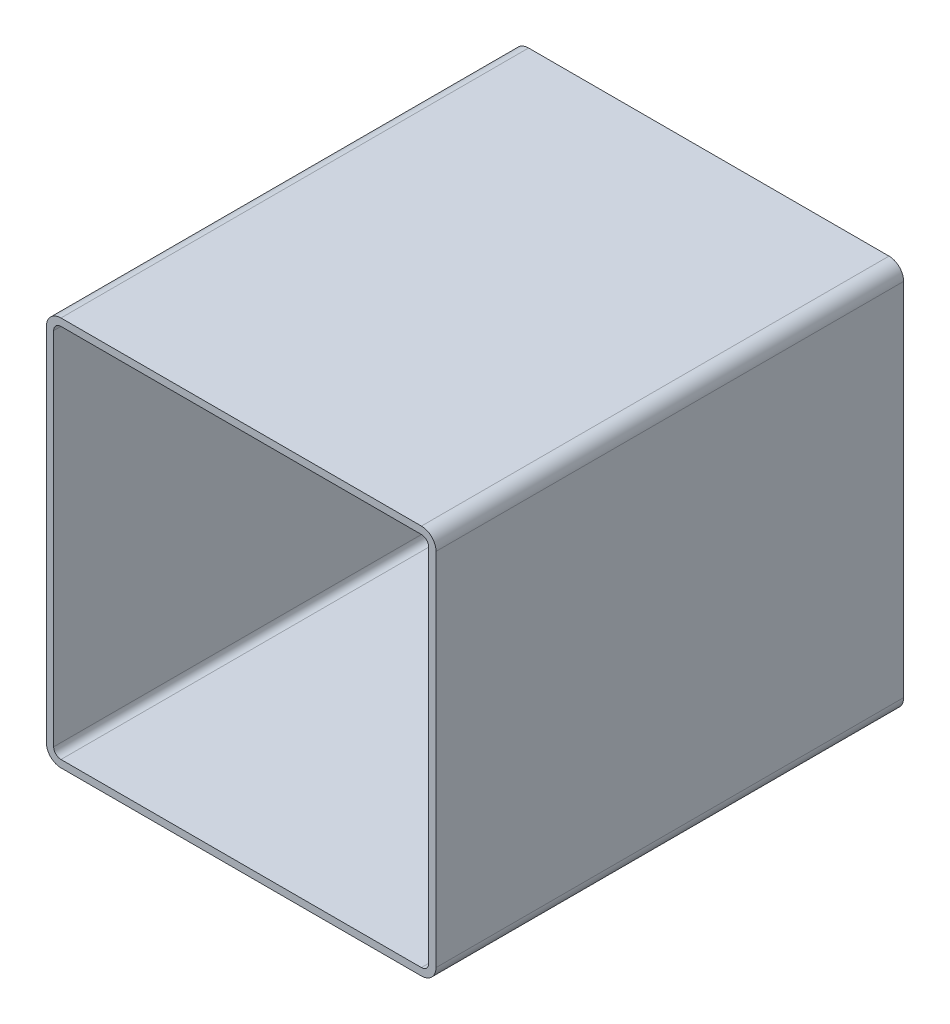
ISO-10303-21;
HEADER;
FILE_DESCRIPTION(('STEP AP214'),'2;1');
FILE_NAME('part.step','',(''),(''),'','','');
FILE_SCHEMA(('AUTOMOTIVE_DESIGN { 1 0 10303 214 1 1 1 1 }'));
ENDSEC;
DATA;
#1=APPLICATION_CONTEXT('core data for automotive mechanical design processes');
#2=APPLICATION_PROTOCOL_DEFINITION('international standard','automotive_design',2000,#1);
#3=PRODUCT_CONTEXT('',#1,'mechanical');
#4=PRODUCT('Part','Part','',(#3));
#5=PRODUCT_RELATED_PRODUCT_CATEGORY('part','',(#4));
#6=PRODUCT_DEFINITION_FORMATION('','',#4);
#7=PRODUCT_DEFINITION_CONTEXT('part definition',#1,'design');
#8=PRODUCT_DEFINITION('design','',#6,#7);
#9=PRODUCT_DEFINITION_SHAPE('','',#8);
#10=(LENGTH_UNIT() NAMED_UNIT(*) SI_UNIT(.MILLI.,.METRE.));
#11=(NAMED_UNIT(*) PLANE_ANGLE_UNIT() SI_UNIT($,.RADIAN.));
#12=(NAMED_UNIT(*) SI_UNIT($,.STERADIAN.) SOLID_ANGLE_UNIT());
#13=UNCERTAINTY_MEASURE_WITH_UNIT(LENGTH_MEASURE(1.E-05),#10,'distance_accuracy_value','');
#14=(GEOMETRIC_REPRESENTATION_CONTEXT(3) GLOBAL_UNCERTAINTY_ASSIGNED_CONTEXT((#13)) GLOBAL_UNIT_ASSIGNED_CONTEXT((#10,
#11,#12)) REPRESENTATION_CONTEXT('',''));
#15=CARTESIAN_POINT('',(0.,0.,0.));
#16=DIRECTION('',(0.,0.,1.));
#17=DIRECTION('',(1.,0.,0.));
#18=AXIS2_PLACEMENT_3D('',#15,#16,#17);
#19=CARTESIAN_POINT('',(12.2595794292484,246.395313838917,304.8));
#20=DIRECTION('',(0.,0.,1.));
#21=DIRECTION('',(1.,0.,0.));
#22=AXIS2_PLACEMENT_3D('',#19,#20,#21);
#23=PLANE('',#22);
#24=CARTESIAN_POINT('',(12.2595794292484,246.395313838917,304.8));
#25=DIRECTION('',(0.,0.,1.));
#26=DIRECTION('',(1.,0.,0.));
#27=AXIS2_PLACEMENT_3D('',#24,#25,#26);
#28=CIRCLE('',#27,9.52500000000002);
#29=CARTESIAN_POINT('',(12.2595794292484,255.920313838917,304.8));
#30=VERTEX_POINT('',#29);
#31=CARTESIAN_POINT('',(2.73457942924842,246.395313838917,304.8));
#32=VERTEX_POINT('',#31);
#33=EDGE_CURVE('E211',#30,#32,#28,.T.);
#34=ORIENTED_EDGE('',*,*,#33,.T.);
#35=DIRECTION('',(0.,-1.,0.));
#36=VECTOR('',#35,1.);
#37=CARTESIAN_POINT('',(2.73457942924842,11.4453138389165,304.8));
#38=LINE('',#37,#36);
#39=CARTESIAN_POINT('',(2.73457942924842,11.4453138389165,304.8));
#40=VERTEX_POINT('',#39);
#41=EDGE_CURVE('E214',#32,#40,#38,.T.);
#42=ORIENTED_EDGE('',*,*,#41,.T.);
#43=CARTESIAN_POINT('',(12.2595794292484,11.4453138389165,304.8));
#44=DIRECTION('',(0.,0.,1.));
#45=DIRECTION('',(1.,0.,0.));
#46=AXIS2_PLACEMENT_3D('',#43,#44,#45);
#47=CIRCLE('',#46,9.525);
#48=CARTESIAN_POINT('',(12.2595794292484,1.92031383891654,304.8));
#49=VERTEX_POINT('',#48);
#50=EDGE_CURVE('E217',#40,#49,#47,.T.);
#51=ORIENTED_EDGE('',*,*,#50,.T.);
#52=DIRECTION('',(1.,0.,0.));
#53=VECTOR('',#52,1.);
#54=CARTESIAN_POINT('',(247.209579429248,1.92031383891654,304.8));
#55=LINE('',#54,#53);
#56=CARTESIAN_POINT('',(247.209579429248,1.92031383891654,304.8));
#57=VERTEX_POINT('',#56);
#58=EDGE_CURVE('E219',#49,#57,#55,.T.);
#59=ORIENTED_EDGE('',*,*,#58,.T.);
#60=CARTESIAN_POINT('',(247.209579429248,11.4453138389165,304.8));
#61=DIRECTION('',(0.,0.,1.));
#62=DIRECTION('',(1.,0.,0.));
#63=AXIS2_PLACEMENT_3D('',#60,#61,#62);
#64=CIRCLE('',#63,9.52500000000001);
#65=CARTESIAN_POINT('',(256.734579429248,11.4453138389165,304.8));
#66=VERTEX_POINT('',#65);
#67=EDGE_CURVE('E221',#57,#66,#64,.T.);
#68=ORIENTED_EDGE('',*,*,#67,.T.);
#69=DIRECTION('',(0.,1.,0.));
#70=VECTOR('',#69,1.);
#71=CARTESIAN_POINT('',(256.734579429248,246.395313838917,304.8));
#72=LINE('',#71,#70);
#73=CARTESIAN_POINT('',(256.734579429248,246.395313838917,304.8));
#74=VERTEX_POINT('',#73);
#75=EDGE_CURVE('E223',#66,#74,#72,.T.);
#76=ORIENTED_EDGE('',*,*,#75,.T.);
#77=CARTESIAN_POINT('',(247.209579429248,246.395313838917,304.8));
#78=DIRECTION('',(0.,0.,1.));
#79=DIRECTION('',(1.,0.,0.));
#80=AXIS2_PLACEMENT_3D('',#77,#78,#79);
#81=CIRCLE('',#80,9.52500000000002);
#82=CARTESIAN_POINT('',(247.209579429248,255.920313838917,304.8));
#83=VERTEX_POINT('',#82);
#84=EDGE_CURVE('E225',#74,#83,#81,.T.);
#85=ORIENTED_EDGE('',*,*,#84,.T.);
#86=DIRECTION('',(-1.,0.,0.));
#87=VECTOR('',#86,1.);
#88=CARTESIAN_POINT('',(12.2595794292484,255.920313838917,304.8));
#89=LINE('',#88,#87);
#90=EDGE_CURVE('E227',#83,#30,#89,.T.);
#91=ORIENTED_EDGE('',*,*,#90,.T.);
#92=EDGE_LOOP('',(#34,#42,#51,#59,#68,#76,#85,#91));
#93=FACE_BOUND('',#92,.T.);
#94=DIRECTION('',(0.,-1.,0.));
#95=VECTOR('',#94,1.);
#96=CARTESIAN_POINT('',(7.49707942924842,11.4453138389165,304.8));
#97=LINE('',#96,#95);
#98=CARTESIAN_POINT('',(7.49707942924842,246.395313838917,304.8));
#99=VERTEX_POINT('',#98);
#100=CARTESIAN_POINT('',(7.49707942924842,11.4453138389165,304.8));
#101=VERTEX_POINT('',#100);
#102=EDGE_CURVE('E154',#99,#101,#97,.T.);
#103=ORIENTED_EDGE('',*,*,#102,.F.);
#104=CARTESIAN_POINT('',(12.2595794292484,246.395313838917,304.8));
#105=DIRECTION('',(0.,0.,1.));
#106=DIRECTION('',(1.,0.,0.));
#107=AXIS2_PLACEMENT_3D('',#104,#105,#106);
#108=CIRCLE('',#107,4.76250000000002);
#109=CARTESIAN_POINT('',(12.2595794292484,251.157813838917,304.8));
#110=VERTEX_POINT('',#109);
#111=EDGE_CURVE('E146',#110,#99,#108,.T.);
#112=ORIENTED_EDGE('',*,*,#111,.F.);
#113=DIRECTION('',(-1.,0.,0.));
#114=VECTOR('',#113,1.);
#115=CARTESIAN_POINT('',(12.2595794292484,251.157813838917,304.8));
#116=LINE('',#115,#114);
#117=CARTESIAN_POINT('',(247.209579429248,251.157813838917,304.8));
#118=VERTEX_POINT('',#117);
#119=EDGE_CURVE('E179',#118,#110,#116,.T.);
#120=ORIENTED_EDGE('',*,*,#119,.F.);
#121=CARTESIAN_POINT('',(247.209579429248,246.395313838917,304.8));
#122=DIRECTION('',(0.,0.,1.));
#123=DIRECTION('',(1.,0.,0.));
#124=AXIS2_PLACEMENT_3D('',#121,#122,#123);
#125=CIRCLE('',#124,4.76250000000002);
#126=CARTESIAN_POINT('',(251.972079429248,246.395313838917,304.8));
#127=VERTEX_POINT('',#126);
#128=EDGE_CURVE('E177',#127,#118,#125,.T.);
#129=ORIENTED_EDGE('',*,*,#128,.F.);
#130=DIRECTION('',(0.,1.,0.));
#131=VECTOR('',#130,1.);
#132=CARTESIAN_POINT('',(251.972079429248,246.395313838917,304.8));
#133=LINE('',#132,#131);
#134=CARTESIAN_POINT('',(251.972079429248,11.4453138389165,304.8));
#135=VERTEX_POINT('',#134);
#136=EDGE_CURVE('E175',#135,#127,#133,.T.);
#137=ORIENTED_EDGE('',*,*,#136,.F.);
#138=CARTESIAN_POINT('',(247.209579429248,11.4453138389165,304.8));
#139=DIRECTION('',(0.,0.,1.));
#140=DIRECTION('',(1.,0.,0.));
#141=AXIS2_PLACEMENT_3D('',#138,#139,#140);
#142=CIRCLE('',#141,4.7625);
#143=CARTESIAN_POINT('',(247.209579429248,6.68281383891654,304.8));
#144=VERTEX_POINT('',#143);
#145=EDGE_CURVE('E173',#144,#135,#142,.T.);
#146=ORIENTED_EDGE('',*,*,#145,.F.);
#147=DIRECTION('',(1.,0.,0.));
#148=VECTOR('',#147,1.);
#149=CARTESIAN_POINT('',(247.209579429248,6.68281383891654,304.8));
#150=LINE('',#149,#148);
#151=CARTESIAN_POINT('',(12.2595794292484,6.68281383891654,304.8));
#152=VERTEX_POINT('',#151);
#153=EDGE_CURVE('E169',#152,#144,#150,.T.);
#154=ORIENTED_EDGE('',*,*,#153,.F.);
#155=CARTESIAN_POINT('',(12.2595794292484,11.4453138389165,304.8));
#156=DIRECTION('',(0.,0.,1.));
#157=DIRECTION('',(1.,0.,0.));
#158=AXIS2_PLACEMENT_3D('',#155,#156,#157);
#159=CIRCLE('',#158,4.7625);
#160=EDGE_CURVE('E167',#101,#152,#159,.T.);
#161=ORIENTED_EDGE('',*,*,#160,.F.);
#162=EDGE_LOOP('',(#103,#112,#120,#129,#137,#146,#154,#161));
#163=FACE_BOUND('',#162,.T.);
#164=ADVANCED_FACE('F33',(#93,#163),#23,.T.);
#165=CARTESIAN_POINT('',(12.2595794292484,246.395313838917,0.));
#166=DIRECTION('',(0.,0.,1.));
#167=DIRECTION('',(1.,0.,0.));
#168=AXIS2_PLACEMENT_3D('',#165,#166,#167);
#169=PLANE('',#168);
#170=CARTESIAN_POINT('',(12.2595794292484,246.395313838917,0.));
#171=DIRECTION('',(0.,0.,1.));
#172=DIRECTION('',(1.,0.,0.));
#173=AXIS2_PLACEMENT_3D('',#170,#171,#172);
#174=CIRCLE('',#173,9.52500000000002);
#175=CARTESIAN_POINT('',(12.2595794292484,255.920313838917,0.));
#176=VERTEX_POINT('',#175);
#177=CARTESIAN_POINT('',(2.73457942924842,246.395313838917,0.));
#178=VERTEX_POINT('',#177);
#179=EDGE_CURVE('E162',#176,#178,#174,.T.);
#180=ORIENTED_EDGE('',*,*,#179,.F.);
#181=DIRECTION('',(-1.,0.,0.));
#182=VECTOR('',#181,1.);
#183=CARTESIAN_POINT('',(12.2595794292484,255.920313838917,0.));
#184=LINE('',#183,#182);
#185=CARTESIAN_POINT('',(247.209579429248,255.920313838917,0.));
#186=VERTEX_POINT('',#185);
#187=EDGE_CURVE('E215',#186,#176,#184,.T.);
#188=ORIENTED_EDGE('',*,*,#187,.F.);
#189=CARTESIAN_POINT('',(247.209579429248,246.395313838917,0.));
#190=DIRECTION('',(0.,0.,1.));
#191=DIRECTION('',(1.,0.,0.));
#192=AXIS2_PLACEMENT_3D('',#189,#190,#191);
#193=CIRCLE('',#192,9.52500000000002);
#194=CARTESIAN_POINT('',(256.734579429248,246.395313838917,0.));
#195=VERTEX_POINT('',#194);
#196=EDGE_CURVE('E242',#195,#186,#193,.T.);
#197=ORIENTED_EDGE('',*,*,#196,.F.);
#198=DIRECTION('',(0.,1.,0.));
#199=VECTOR('',#198,1.);
#200=CARTESIAN_POINT('',(256.734579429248,246.395313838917,0.));
#201=LINE('',#200,#199);
#202=CARTESIAN_POINT('',(256.734579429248,11.4453138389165,0.));
#203=VERTEX_POINT('',#202);
#204=EDGE_CURVE('E240',#203,#195,#201,.T.);
#205=ORIENTED_EDGE('',*,*,#204,.F.);
#206=CARTESIAN_POINT('',(247.209579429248,11.4453138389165,0.));
#207=DIRECTION('',(0.,0.,1.));
#208=DIRECTION('',(1.,0.,0.));
#209=AXIS2_PLACEMENT_3D('',#206,#207,#208);
#210=CIRCLE('',#209,9.52500000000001);
#211=CARTESIAN_POINT('',(247.209579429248,1.92031383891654,0.));
#212=VERTEX_POINT('',#211);
#213=EDGE_CURVE('E238',#212,#203,#210,.T.);
#214=ORIENTED_EDGE('',*,*,#213,.F.);
#215=DIRECTION('',(1.,0.,0.));
#216=VECTOR('',#215,1.);
#217=CARTESIAN_POINT('',(247.209579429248,1.92031383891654,0.));
#218=LINE('',#217,#216);
#219=CARTESIAN_POINT('',(12.2595794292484,1.92031383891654,0.));
#220=VERTEX_POINT('',#219);
#221=EDGE_CURVE('E236',#220,#212,#218,.T.);
#222=ORIENTED_EDGE('',*,*,#221,.F.);
#223=CARTESIAN_POINT('',(12.2595794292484,11.4453138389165,0.));
#224=DIRECTION('',(0.,0.,1.));
#225=DIRECTION('',(1.,0.,0.));
#226=AXIS2_PLACEMENT_3D('',#223,#224,#225);
#227=CIRCLE('',#226,9.525);
#228=CARTESIAN_POINT('',(2.73457942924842,11.4453138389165,0.));
#229=VERTEX_POINT('',#228);
#230=EDGE_CURVE('E234',#229,#220,#227,.T.);
#231=ORIENTED_EDGE('',*,*,#230,.F.);
#232=DIRECTION('',(0.,-1.,0.));
#233=VECTOR('',#232,1.);
#234=CARTESIAN_POINT('',(2.73457942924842,11.4453138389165,0.));
#235=LINE('',#234,#233);
#236=EDGE_CURVE('E232',#178,#229,#235,.T.);
#237=ORIENTED_EDGE('',*,*,#236,.F.);
#238=EDGE_LOOP('',(#180,#188,#197,#205,#214,#222,#231,#237));
#239=FACE_BOUND('',#238,.T.);
#240=CARTESIAN_POINT('',(12.2595794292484,246.395313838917,0.));
#241=DIRECTION('',(0.,0.,1.));
#242=DIRECTION('',(1.,0.,0.));
#243=AXIS2_PLACEMENT_3D('',#240,#241,#242);
#244=CIRCLE('',#243,4.76250000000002);
#245=CARTESIAN_POINT('',(12.2595794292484,251.157813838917,0.));
#246=VERTEX_POINT('',#245);
#247=CARTESIAN_POINT('',(7.49707942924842,246.395313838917,0.));
#248=VERTEX_POINT('',#247);
#249=EDGE_CURVE('E56',#246,#248,#244,.T.);
#250=ORIENTED_EDGE('',*,*,#249,.T.);
#251=DIRECTION('',(0.,-1.,0.));
#252=VECTOR('',#251,1.);
#253=CARTESIAN_POINT('',(7.49707942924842,11.4453138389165,0.));
#254=LINE('',#253,#252);
#255=CARTESIAN_POINT('',(7.49707942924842,11.4453138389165,0.));
#256=VERTEX_POINT('',#255);
#257=EDGE_CURVE('E161',#248,#256,#254,.T.);
#258=ORIENTED_EDGE('',*,*,#257,.T.);
#259=CARTESIAN_POINT('',(12.2595794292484,11.4453138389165,0.));
#260=DIRECTION('',(0.,0.,1.));
#261=DIRECTION('',(1.,0.,0.));
#262=AXIS2_PLACEMENT_3D('',#259,#260,#261);
#263=CIRCLE('',#262,4.7625);
#264=CARTESIAN_POINT('',(12.2595794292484,6.68281383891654,0.));
#265=VERTEX_POINT('',#264);
#266=EDGE_CURVE('E183',#256,#265,#263,.T.);
#267=ORIENTED_EDGE('',*,*,#266,.T.);
#268=DIRECTION('',(1.,0.,0.));
#269=VECTOR('',#268,1.);
#270=CARTESIAN_POINT('',(247.209579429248,6.68281383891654,0.));
#271=LINE('',#270,#269);
#272=CARTESIAN_POINT('',(247.209579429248,6.68281383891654,0.));
#273=VERTEX_POINT('',#272);
#274=EDGE_CURVE('E186',#265,#273,#271,.T.);
#275=ORIENTED_EDGE('',*,*,#274,.T.);
#276=CARTESIAN_POINT('',(247.209579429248,11.4453138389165,0.));
#277=DIRECTION('',(0.,0.,1.));
#278=DIRECTION('',(1.,0.,0.));
#279=AXIS2_PLACEMENT_3D('',#276,#277,#278);
#280=CIRCLE('',#279,4.7625);
#281=CARTESIAN_POINT('',(251.972079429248,11.4453138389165,0.));
#282=VERTEX_POINT('',#281);
#283=EDGE_CURVE('E189',#273,#282,#280,.T.);
#284=ORIENTED_EDGE('',*,*,#283,.T.);
#285=DIRECTION('',(0.,1.,0.));
#286=VECTOR('',#285,1.);
#287=CARTESIAN_POINT('',(251.972079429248,246.395313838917,0.));
#288=LINE('',#287,#286);
#289=CARTESIAN_POINT('',(251.972079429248,246.395313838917,0.));
#290=VERTEX_POINT('',#289);
#291=EDGE_CURVE('E192',#282,#290,#288,.T.);
#292=ORIENTED_EDGE('',*,*,#291,.T.);
#293=CARTESIAN_POINT('',(247.209579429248,246.395313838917,0.));
#294=DIRECTION('',(0.,0.,1.));
#295=DIRECTION('',(1.,0.,0.));
#296=AXIS2_PLACEMENT_3D('',#293,#294,#295);
#297=CIRCLE('',#296,4.76250000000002);
#298=CARTESIAN_POINT('',(247.209579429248,251.157813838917,0.));
#299=VERTEX_POINT('',#298);
#300=EDGE_CURVE('E195',#290,#299,#297,.T.);
#301=ORIENTED_EDGE('',*,*,#300,.T.);
#302=DIRECTION('',(-1.,0.,0.));
#303=VECTOR('',#302,1.);
#304=CARTESIAN_POINT('',(12.2595794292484,251.157813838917,0.));
#305=LINE('',#304,#303);
#306=EDGE_CURVE('E155',#299,#246,#305,.T.);
#307=ORIENTED_EDGE('',*,*,#306,.T.);
#308=EDGE_LOOP('',(#250,#258,#267,#275,#284,#292,#301,#307));
#309=FACE_BOUND('',#308,.T.);
#310=ADVANCED_FACE('F272',(#239,#309),#169,.F.);
#311=CARTESIAN_POINT('',(12.2595794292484,246.395313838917,304.8));
#312=DIRECTION('',(0.,0.,-1.));
#313=DIRECTION('',(-1.,0.,0.));
#314=AXIS2_PLACEMENT_3D('',#311,#312,#313);
#315=CYLINDRICAL_SURFACE('',#314,9.52500000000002);
#316=ORIENTED_EDGE('',*,*,#179,.T.);
#317=DIRECTION('',(0.,0.,-1.));
#318=VECTOR('',#317,1.);
#319=CARTESIAN_POINT('',(2.73457942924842,246.395313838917,304.8));
#320=LINE('',#319,#318);
#321=EDGE_CURVE('E11',#32,#178,#320,.T.);
#322=ORIENTED_EDGE('',*,*,#321,.F.);
#323=ORIENTED_EDGE('',*,*,#33,.F.);
#324=DIRECTION('',(0.,0.,-1.));
#325=VECTOR('',#324,1.);
#326=CARTESIAN_POINT('',(12.2595794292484,255.920313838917,304.8));
#327=LINE('',#326,#325);
#328=EDGE_CURVE('E229',#30,#176,#327,.T.);
#329=ORIENTED_EDGE('',*,*,#328,.T.);
#330=EDGE_LOOP('',(#316,#322,#323,#329));
#331=FACE_BOUND('',#330,.T.);
#332=ADVANCED_FACE('F35',(#331),#315,.T.);
#333=CARTESIAN_POINT('',(2.73457942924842,11.4453138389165,304.8));
#334=DIRECTION('',(1.,0.,0.));
#335=DIRECTION('',(0.,0.,-1.));
#336=AXIS2_PLACEMENT_3D('',#333,#334,#335);
#337=PLANE('',#336);
#338=ORIENTED_EDGE('',*,*,#236,.T.);
#339=DIRECTION('',(0.,0.,-1.));
#340=VECTOR('',#339,1.);
#341=CARTESIAN_POINT('',(2.73457942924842,11.4453138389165,304.8));
#342=LINE('',#341,#340);
#343=EDGE_CURVE('E41',#40,#229,#342,.T.);
#344=ORIENTED_EDGE('',*,*,#343,.F.);
#345=ORIENTED_EDGE('',*,*,#41,.F.);
#346=ORIENTED_EDGE('',*,*,#321,.T.);
#347=EDGE_LOOP('',(#338,#344,#345,#346));
#348=FACE_BOUND('',#347,.T.);
#349=ADVANCED_FACE('F289',(#348),#337,.F.);
#350=CARTESIAN_POINT('',(12.2595794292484,11.4453138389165,304.8));
#351=DIRECTION('',(0.,0.,-1.));
#352=DIRECTION('',(-1.,0.,0.));
#353=AXIS2_PLACEMENT_3D('',#350,#351,#352);
#354=CYLINDRICAL_SURFACE('',#353,9.525);
#355=ORIENTED_EDGE('',*,*,#230,.T.);
#356=DIRECTION('',(0.,0.,-1.));
#357=VECTOR('',#356,1.);
#358=CARTESIAN_POINT('',(12.2595794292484,1.92031383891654,304.8));
#359=LINE('',#358,#357);
#360=EDGE_CURVE('E259',#49,#220,#359,.T.);
#361=ORIENTED_EDGE('',*,*,#360,.F.);
#362=ORIENTED_EDGE('',*,*,#50,.F.);
#363=ORIENTED_EDGE('',*,*,#343,.T.);
#364=EDGE_LOOP('',(#355,#361,#362,#363));
#365=FACE_BOUND('',#364,.T.);
#366=ADVANCED_FACE('F266',(#365),#354,.T.);
#367=CARTESIAN_POINT('',(247.209579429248,1.92031383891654,304.8));
#368=DIRECTION('',(0.,1.,0.));
#369=DIRECTION('',(0.,0.,1.));
#370=AXIS2_PLACEMENT_3D('',#367,#368,#369);
#371=PLANE('',#370);
#372=ORIENTED_EDGE('',*,*,#221,.T.);
#373=DIRECTION('',(0.,0.,-1.));
#374=VECTOR('',#373,1.);
#375=CARTESIAN_POINT('',(247.209579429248,1.92031383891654,304.8));
#376=LINE('',#375,#374);
#377=EDGE_CURVE('E256',#57,#212,#376,.T.);
#378=ORIENTED_EDGE('',*,*,#377,.F.);
#379=ORIENTED_EDGE('',*,*,#58,.F.);
#380=ORIENTED_EDGE('',*,*,#360,.T.);
#381=EDGE_LOOP('',(#372,#378,#379,#380));
#382=FACE_BOUND('',#381,.T.);
#383=ADVANCED_FACE('F278',(#382),#371,.F.);
#384=CARTESIAN_POINT('',(247.209579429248,11.4453138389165,304.8));
#385=DIRECTION('',(0.,0.,-1.));
#386=DIRECTION('',(-1.,0.,0.));
#387=AXIS2_PLACEMENT_3D('',#384,#385,#386);
#388=CYLINDRICAL_SURFACE('',#387,9.52500000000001);
#389=ORIENTED_EDGE('',*,*,#213,.T.);
#390=DIRECTION('',(0.,0.,-1.));
#391=VECTOR('',#390,1.);
#392=CARTESIAN_POINT('',(256.734579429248,11.4453138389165,304.8));
#393=LINE('',#392,#391);
#394=EDGE_CURVE('E253',#66,#203,#393,.T.);
#395=ORIENTED_EDGE('',*,*,#394,.F.);
#396=ORIENTED_EDGE('',*,*,#67,.F.);
#397=ORIENTED_EDGE('',*,*,#377,.T.);
#398=EDGE_LOOP('',(#389,#395,#396,#397));
#399=FACE_BOUND('',#398,.T.);
#400=ADVANCED_FACE('F282',(#399),#388,.T.);
#401=CARTESIAN_POINT('',(256.734579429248,246.395313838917,304.8));
#402=DIRECTION('',(-1.,0.,0.));
#403=DIRECTION('',(0.,0.,1.));
#404=AXIS2_PLACEMENT_3D('',#401,#402,#403);
#405=PLANE('',#404);
#406=ORIENTED_EDGE('',*,*,#204,.T.);
#407=DIRECTION('',(0.,0.,-1.));
#408=VECTOR('',#407,1.);
#409=CARTESIAN_POINT('',(256.734579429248,246.395313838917,304.8));
#410=LINE('',#409,#408);
#411=EDGE_CURVE('E250',#74,#195,#410,.T.);
#412=ORIENTED_EDGE('',*,*,#411,.F.);
#413=ORIENTED_EDGE('',*,*,#75,.F.);
#414=ORIENTED_EDGE('',*,*,#394,.T.);
#415=EDGE_LOOP('',(#406,#412,#413,#414));
#416=FACE_BOUND('',#415,.T.);
#417=ADVANCED_FACE('F302',(#416),#405,.F.);
#418=CARTESIAN_POINT('',(247.209579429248,246.395313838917,304.8));
#419=DIRECTION('',(0.,0.,-1.));
#420=DIRECTION('',(-1.,0.,0.));
#421=AXIS2_PLACEMENT_3D('',#418,#419,#420);
#422=CYLINDRICAL_SURFACE('',#421,9.52500000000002);
#423=ORIENTED_EDGE('',*,*,#196,.T.);
#424=DIRECTION('',(0.,0.,-1.));
#425=VECTOR('',#424,1.);
#426=CARTESIAN_POINT('',(247.209579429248,255.920313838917,304.8));
#427=LINE('',#426,#425);
#428=EDGE_CURVE('E247',#83,#186,#427,.T.);
#429=ORIENTED_EDGE('',*,*,#428,.F.);
#430=ORIENTED_EDGE('',*,*,#84,.F.);
#431=ORIENTED_EDGE('',*,*,#411,.T.);
#432=EDGE_LOOP('',(#423,#429,#430,#431));
#433=FACE_BOUND('',#432,.T.);
#434=ADVANCED_FACE('F300',(#433),#422,.T.);
#435=CARTESIAN_POINT('',(12.2595794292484,255.920313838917,304.8));
#436=DIRECTION('',(0.,-1.,0.));
#437=DIRECTION('',(0.,0.,-1.));
#438=AXIS2_PLACEMENT_3D('',#435,#436,#437);
#439=PLANE('',#438);
#440=ORIENTED_EDGE('',*,*,#187,.T.);
#441=ORIENTED_EDGE('',*,*,#328,.F.);
#442=ORIENTED_EDGE('',*,*,#90,.F.);
#443=ORIENTED_EDGE('',*,*,#428,.T.);
#444=EDGE_LOOP('',(#440,#441,#442,#443));
#445=FACE_BOUND('',#444,.T.);
#446=ADVANCED_FACE('F295',(#445),#439,.F.);
#447=CARTESIAN_POINT('',(12.2595794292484,246.395313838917,304.8));
#448=DIRECTION('',(0.,0.,-1.));
#449=DIRECTION('',(-1.,0.,0.));
#450=AXIS2_PLACEMENT_3D('',#447,#448,#449);
#451=CYLINDRICAL_SURFACE('',#450,4.76250000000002);
#452=ORIENTED_EDGE('',*,*,#249,.F.);
#453=DIRECTION('',(0.,0.,-1.));
#454=VECTOR('',#453,1.);
#455=CARTESIAN_POINT('',(12.2595794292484,251.157813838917,304.8));
#456=LINE('',#455,#454);
#457=EDGE_CURVE('E150',#110,#246,#456,.T.);
#458=ORIENTED_EDGE('',*,*,#457,.F.);
#459=ORIENTED_EDGE('',*,*,#111,.T.);
#460=DIRECTION('',(0.,0.,-1.));
#461=VECTOR('',#460,1.);
#462=CARTESIAN_POINT('',(7.49707942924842,246.395313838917,304.8));
#463=LINE('',#462,#461);
#464=EDGE_CURVE('E149',#99,#248,#463,.T.);
#465=ORIENTED_EDGE('',*,*,#464,.T.);
#466=EDGE_LOOP('',(#452,#458,#459,#465));
#467=FACE_BOUND('',#466,.T.);
#468=ADVANCED_FACE('F148',(#467),#451,.F.);
#469=CARTESIAN_POINT('',(7.49707942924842,11.4453138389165,304.8));
#470=DIRECTION('',(1.,0.,0.));
#471=DIRECTION('',(0.,0.,-1.));
#472=AXIS2_PLACEMENT_3D('',#469,#470,#471);
#473=PLANE('',#472);
#474=ORIENTED_EDGE('',*,*,#257,.F.);
#475=ORIENTED_EDGE('',*,*,#464,.F.);
#476=ORIENTED_EDGE('',*,*,#102,.T.);
#477=DIRECTION('',(0.,0.,-1.));
#478=VECTOR('',#477,1.);
#479=CARTESIAN_POINT('',(7.49707942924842,11.4453138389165,304.8));
#480=LINE('',#479,#478);
#481=EDGE_CURVE('E163',#101,#256,#480,.T.);
#482=ORIENTED_EDGE('',*,*,#481,.T.);
#483=EDGE_LOOP('',(#474,#475,#476,#482));
#484=FACE_BOUND('',#483,.T.);
#485=ADVANCED_FACE('F158',(#484),#473,.T.);
#486=CARTESIAN_POINT('',(12.2595794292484,11.4453138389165,304.8));
#487=DIRECTION('',(0.,0.,-1.));
#488=DIRECTION('',(-1.,0.,0.));
#489=AXIS2_PLACEMENT_3D('',#486,#487,#488);
#490=CYLINDRICAL_SURFACE('',#489,4.7625);
#491=ORIENTED_EDGE('',*,*,#266,.F.);
#492=ORIENTED_EDGE('',*,*,#481,.F.);
#493=ORIENTED_EDGE('',*,*,#160,.T.);
#494=DIRECTION('',(0.,0.,-1.));
#495=VECTOR('',#494,1.);
#496=CARTESIAN_POINT('',(12.2595794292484,6.68281383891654,304.8));
#497=LINE('',#496,#495);
#498=EDGE_CURVE('E208',#152,#265,#497,.T.);
#499=ORIENTED_EDGE('',*,*,#498,.T.);
#500=EDGE_LOOP('',(#491,#492,#493,#499));
#501=FACE_BOUND('',#500,.T.);
#502=ADVANCED_FACE('F327',(#501),#490,.F.);
#503=CARTESIAN_POINT('',(247.209579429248,6.68281383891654,304.8));
#504=DIRECTION('',(0.,1.,0.));
#505=DIRECTION('',(0.,0.,1.));
#506=AXIS2_PLACEMENT_3D('',#503,#504,#505);
#507=PLANE('',#506);
#508=ORIENTED_EDGE('',*,*,#274,.F.);
#509=ORIENTED_EDGE('',*,*,#498,.F.);
#510=ORIENTED_EDGE('',*,*,#153,.T.);
#511=DIRECTION('',(0.,0.,-1.));
#512=VECTOR('',#511,1.);
#513=CARTESIAN_POINT('',(247.209579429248,6.68281383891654,304.8));
#514=LINE('',#513,#512);
#515=EDGE_CURVE('E206',#144,#273,#514,.T.);
#516=ORIENTED_EDGE('',*,*,#515,.T.);
#517=EDGE_LOOP('',(#508,#509,#510,#516));
#518=FACE_BOUND('',#517,.T.);
#519=ADVANCED_FACE('F331',(#518),#507,.T.);
#520=CARTESIAN_POINT('',(247.209579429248,11.4453138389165,304.8));
#521=DIRECTION('',(0.,0.,-1.));
#522=DIRECTION('',(-1.,0.,0.));
#523=AXIS2_PLACEMENT_3D('',#520,#521,#522);
#524=CYLINDRICAL_SURFACE('',#523,4.7625);
#525=ORIENTED_EDGE('',*,*,#283,.F.);
#526=ORIENTED_EDGE('',*,*,#515,.F.);
#527=ORIENTED_EDGE('',*,*,#145,.T.);
#528=DIRECTION('',(0.,0.,-1.));
#529=VECTOR('',#528,1.);
#530=CARTESIAN_POINT('',(251.972079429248,11.4453138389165,304.8));
#531=LINE('',#530,#529);
#532=EDGE_CURVE('E204',#135,#282,#531,.T.);
#533=ORIENTED_EDGE('',*,*,#532,.T.);
#534=EDGE_LOOP('',(#525,#526,#527,#533));
#535=FACE_BOUND('',#534,.T.);
#536=ADVANCED_FACE('F337',(#535),#524,.F.);
#537=CARTESIAN_POINT('',(251.972079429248,246.395313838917,304.8));
#538=DIRECTION('',(-1.,0.,0.));
#539=DIRECTION('',(0.,0.,1.));
#540=AXIS2_PLACEMENT_3D('',#537,#538,#539);
#541=PLANE('',#540);
#542=ORIENTED_EDGE('',*,*,#291,.F.);
#543=ORIENTED_EDGE('',*,*,#532,.F.);
#544=ORIENTED_EDGE('',*,*,#136,.T.);
#545=DIRECTION('',(0.,0.,-1.));
#546=VECTOR('',#545,1.);
#547=CARTESIAN_POINT('',(251.972079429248,246.395313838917,304.8));
#548=LINE('',#547,#546);
#549=EDGE_CURVE('E202',#127,#290,#548,.T.);
#550=ORIENTED_EDGE('',*,*,#549,.T.);
#551=EDGE_LOOP('',(#542,#543,#544,#550));
#552=FACE_BOUND('',#551,.T.);
#553=ADVANCED_FACE('F341',(#552),#541,.T.);
#554=CARTESIAN_POINT('',(247.209579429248,246.395313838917,304.8));
#555=DIRECTION('',(0.,0.,-1.));
#556=DIRECTION('',(-1.,0.,0.));
#557=AXIS2_PLACEMENT_3D('',#554,#555,#556);
#558=CYLINDRICAL_SURFACE('',#557,4.76250000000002);
#559=ORIENTED_EDGE('',*,*,#300,.F.);
#560=ORIENTED_EDGE('',*,*,#549,.F.);
#561=ORIENTED_EDGE('',*,*,#128,.T.);
#562=DIRECTION('',(0.,0.,-1.));
#563=VECTOR('',#562,1.);
#564=CARTESIAN_POINT('',(247.209579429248,251.157813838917,304.8));
#565=LINE('',#564,#563);
#566=EDGE_CURVE('E48',#118,#299,#565,.T.);
#567=ORIENTED_EDGE('',*,*,#566,.T.);
#568=EDGE_LOOP('',(#559,#560,#561,#567));
#569=FACE_BOUND('',#568,.T.);
#570=ADVANCED_FACE('F345',(#569),#558,.F.);
#571=CARTESIAN_POINT('',(12.2595794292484,251.157813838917,304.8));
#572=DIRECTION('',(0.,-1.,0.));
#573=DIRECTION('',(0.,0.,-1.));
#574=AXIS2_PLACEMENT_3D('',#571,#572,#573);
#575=PLANE('',#574);
#576=ORIENTED_EDGE('',*,*,#306,.F.);
#577=ORIENTED_EDGE('',*,*,#566,.F.);
#578=ORIENTED_EDGE('',*,*,#119,.T.);
#579=ORIENTED_EDGE('',*,*,#457,.T.);
#580=EDGE_LOOP('',(#576,#577,#578,#579));
#581=FACE_BOUND('',#580,.T.);
#582=ADVANCED_FACE('F349',(#581),#575,.T.);
#583=CLOSED_SHELL('',(#164,#310,#332,#349,#366,#383,#400,#417,#434,#446,#468,#485,#502,#519,
#536,#553,#570,#582));
#584=MANIFOLD_SOLID_BREP('B2',#583);
#585=ADVANCED_BREP_SHAPE_REPRESENTATION('',(#18,#584),#14);
#586=SHAPE_DEFINITION_REPRESENTATION(#9,#585);
ENDSEC;
END-ISO-10303-21;
